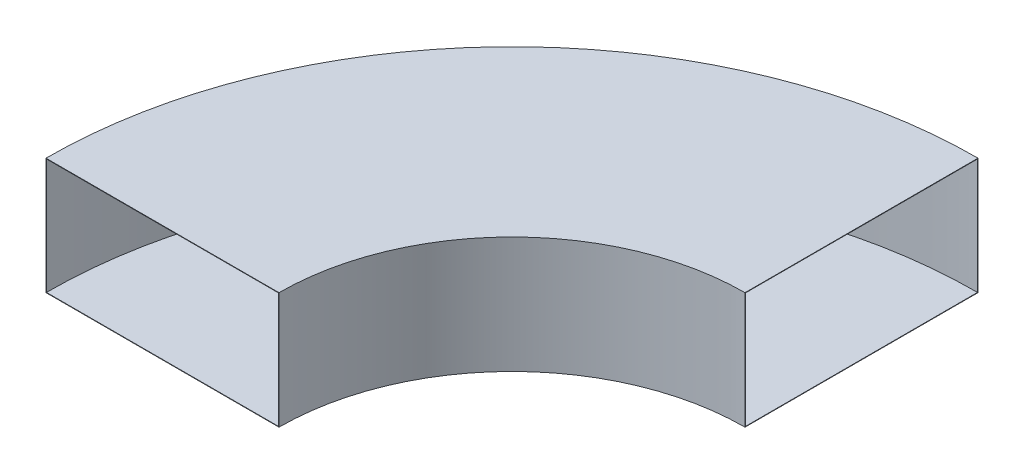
from build123d import *

# Parameters (mm, degrees)
SKETCH1_W   = 1000
SKETCH1_H   = 500
SKETCH1_W_2 = 996
SKETCH1_H_2 = 496


with BuildPart() as part:
    # Sweep-Thin1: sweep along a path in ElbowArc
    with BuildLine(Plane(origin=(0, 0, 0), x_dir=(1, 0, 0), z_dir=(0, 1, 0))) as sweep_thin1_path:
        ThreePointArc((0, 1500), (-1060.66017178, 1060.66017178), (-1500, 0))
    # Sketch1 → Sweep-Thin1 (sweep)
    with BuildSketch(Plane(origin=(0, 0, 0), x_dir=(0, 0, -1), z_dir=(1, 0, 0))):
        with Locations((1500, 0)):
            Rectangle(SKETCH1_W, SKETCH1_H)
        with Locations((1500, 0)):
            Rectangle(SKETCH1_W_2, SKETCH1_H_2, mode=Mode.SUBTRACT)
    sweep(path=sweep_thin1_path.line)


solid = part.part
